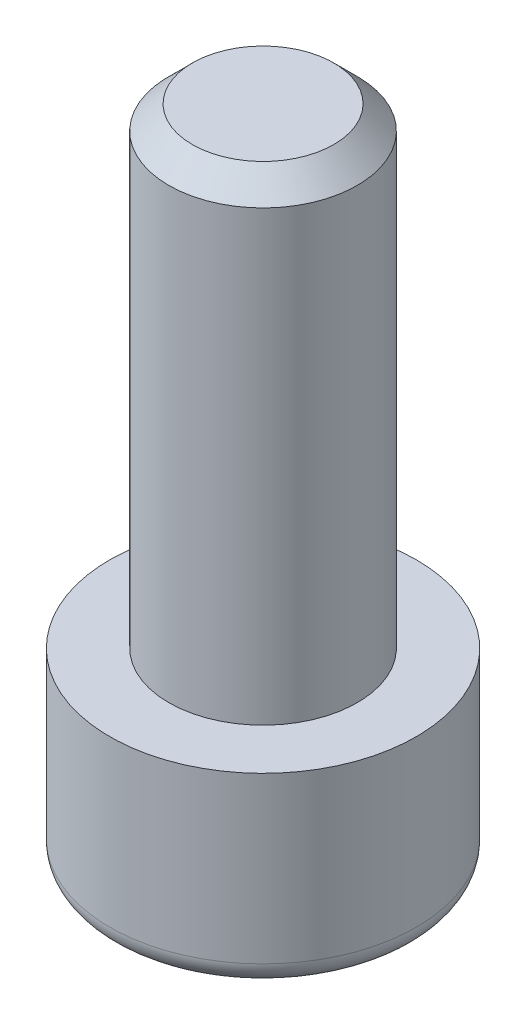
ISO-10303-21;
HEADER;
FILE_DESCRIPTION(('STEP AP214'),'2;1');
FILE_NAME('part.step','',(''),(''),'','','');
FILE_SCHEMA(('AUTOMOTIVE_DESIGN { 1 0 10303 214 1 1 1 1 }'));
ENDSEC;
DATA;
#1=APPLICATION_CONTEXT('core data for automotive mechanical design processes');
#2=APPLICATION_PROTOCOL_DEFINITION('international standard','automotive_design',2000,#1);
#3=PRODUCT_CONTEXT('',#1,'mechanical');
#4=PRODUCT('Part','Part','',(#3));
#5=PRODUCT_RELATED_PRODUCT_CATEGORY('part','',(#4));
#6=PRODUCT_DEFINITION_FORMATION('','',#4);
#7=PRODUCT_DEFINITION_CONTEXT('part definition',#1,'design');
#8=PRODUCT_DEFINITION('design','',#6,#7);
#9=PRODUCT_DEFINITION_SHAPE('','',#8);
#10=(LENGTH_UNIT() NAMED_UNIT(*) SI_UNIT(.MILLI.,.METRE.));
#11=(NAMED_UNIT(*) PLANE_ANGLE_UNIT() SI_UNIT($,.RADIAN.));
#12=(NAMED_UNIT(*) SI_UNIT($,.STERADIAN.) SOLID_ANGLE_UNIT());
#13=UNCERTAINTY_MEASURE_WITH_UNIT(LENGTH_MEASURE(1.E-05),#10,'distance_accuracy_value','');
#14=(GEOMETRIC_REPRESENTATION_CONTEXT(3) GLOBAL_UNCERTAINTY_ASSIGNED_CONTEXT((#13)) GLOBAL_UNIT_ASSIGNED_CONTEXT((#10,
#11,#12)) REPRESENTATION_CONTEXT('',''));
#15=CARTESIAN_POINT('',(0.,0.,0.));
#16=DIRECTION('',(0.,0.,1.));
#17=DIRECTION('',(1.,0.,0.));
#18=AXIS2_PLACEMENT_3D('',#15,#16,#17);
#19=CARTESIAN_POINT('',(0.,20.,0.));
#20=DIRECTION('',(0.,-1.,0.));
#21=DIRECTION('',(0.,0.,-1.));
#22=AXIS2_PLACEMENT_3D('',#19,#20,#21);
#23=CYLINDRICAL_SURFACE('',#22,4.);
#24=CARTESIAN_POINT('',(0.,19.,0.));
#25=DIRECTION('',(0.,1.,0.));
#26=DIRECTION('',(0.,0.,1.));
#27=AXIS2_PLACEMENT_3D('',#24,#25,#26);
#28=CIRCLE('',#27,4.);
#29=CARTESIAN_POINT('',(0.,19.,4.));
#30=VERTEX_POINT('',#29);
#31=EDGE_CURVE('E147',#30,#30,#28,.F.);
#32=ORIENTED_EDGE('',*,*,#31,.T.);
#33=EDGE_LOOP('',(#32));
#34=FACE_BOUND('',#33,.T.);
#35=CARTESIAN_POINT('',(0.,0.,0.));
#36=DIRECTION('',(0.,-1.,0.));
#37=DIRECTION('',(0.,0.,-1.));
#38=AXIS2_PLACEMENT_3D('',#35,#36,#37);
#39=CIRCLE('',#38,4.);
#40=CARTESIAN_POINT('',(0.,0.,-4.));
#41=VERTEX_POINT('',#40);
#42=EDGE_CURVE('E141',#41,#41,#39,.T.);
#43=ORIENTED_EDGE('',*,*,#42,.F.);
#44=EDGE_LOOP('',(#43));
#45=FACE_BOUND('',#44,.T.);
#46=ADVANCED_FACE('F30',(#34,#45),#23,.T.);
#47=CARTESIAN_POINT('',(0.,20.,0.));
#48=DIRECTION('',(0.,1.,0.));
#49=DIRECTION('',(0.,0.,1.));
#50=AXIS2_PLACEMENT_3D('',#47,#48,#49);
#51=PLANE('',#50);
#52=CARTESIAN_POINT('',(0.,20.,0.));
#53=DIRECTION('',(0.,1.,0.));
#54=DIRECTION('',(0.,0.,1.));
#55=AXIS2_PLACEMENT_3D('',#52,#53,#54);
#56=CIRCLE('',#55,3.);
#57=CARTESIAN_POINT('',(0.,20.,3.));
#58=VERTEX_POINT('',#57);
#59=EDGE_CURVE('E144',#58,#58,#56,.T.);
#60=ORIENTED_EDGE('',*,*,#59,.T.);
#61=EDGE_LOOP('',(#60));
#62=FACE_BOUND('',#61,.T.);
#63=ADVANCED_FACE('F168',(#62),#51,.T.);
#64=CARTESIAN_POINT('',(0.,20.,0.));
#65=DIRECTION('',(0.,-1.,0.));
#66=DIRECTION('',(0.,0.,-1.));
#67=AXIS2_PLACEMENT_3D('',#64,#65,#66);
#68=CONICAL_SURFACE('',#67,3.,0.785398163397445);
#69=ORIENTED_EDGE('',*,*,#31,.F.);
#70=EDGE_LOOP('',(#69));
#71=FACE_BOUND('',#70,.T.);
#72=ORIENTED_EDGE('',*,*,#59,.F.);
#73=EDGE_LOOP('',(#72));
#74=FACE_BOUND('',#73,.T.);
#75=ADVANCED_FACE('F173',(#71,#74),#68,.T.);
#76=CARTESIAN_POINT('',(0.,0.,0.));
#77=DIRECTION('',(0.,-1.,0.));
#78=DIRECTION('',(0.,0.,-1.));
#79=AXIS2_PLACEMENT_3D('',#76,#77,#78);
#80=PLANE('',#79);
#81=CARTESIAN_POINT('',(0.,0.,0.));
#82=DIRECTION('',(0.,-1.,0.));
#83=DIRECTION('',(0.,0.,-1.));
#84=AXIS2_PLACEMENT_3D('',#81,#82,#83);
#85=CIRCLE('',#84,6.5);
#86=CARTESIAN_POINT('',(0.,0.,-6.5));
#87=VERTEX_POINT('',#86);
#88=EDGE_CURVE('E132',#87,#87,#85,.T.);
#89=ORIENTED_EDGE('',*,*,#88,.F.);
#90=EDGE_LOOP('',(#89));
#91=FACE_BOUND('',#90,.T.);
#92=ORIENTED_EDGE('',*,*,#42,.T.);
#93=EDGE_LOOP('',(#92));
#94=FACE_BOUND('',#93,.T.);
#95=ADVANCED_FACE('F179',(#91,#94),#80,.F.);
#96=CARTESIAN_POINT('',(0.,-8.,0.));
#97=DIRECTION('',(0.,1.,0.));
#98=DIRECTION('',(0.,0.,1.));
#99=AXIS2_PLACEMENT_3D('',#96,#97,#98);
#100=CYLINDRICAL_SURFACE('',#99,6.5);
#101=CARTESIAN_POINT('',(0.,-7.,0.));
#102=DIRECTION('',(0.,-1.,0.));
#103=DIRECTION('',(0.,0.,-1.));
#104=AXIS2_PLACEMENT_3D('',#101,#102,#103);
#105=CIRCLE('',#104,6.5);
#106=CARTESIAN_POINT('',(0.,-7.,-6.5));
#107=VERTEX_POINT('',#106);
#108=EDGE_CURVE('E11',#107,#107,#105,.F.);
#109=ORIENTED_EDGE('',*,*,#108,.T.);
#110=EDGE_LOOP('',(#109));
#111=FACE_BOUND('',#110,.T.);
#112=ORIENTED_EDGE('',*,*,#88,.T.);
#113=EDGE_LOOP('',(#112));
#114=FACE_BOUND('',#113,.T.);
#115=ADVANCED_FACE('F163',(#111,#114),#100,.T.);
#116=CARTESIAN_POINT('',(0.,-8.,0.));
#117=DIRECTION('',(0.,-1.,0.));
#118=DIRECTION('',(0.,0.,-1.));
#119=AXIS2_PLACEMENT_3D('',#116,#117,#118);
#120=PLANE('',#119);
#121=DIRECTION('',(-0.867435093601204,0.,0.497550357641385));
#122=VECTOR('',#121,1.);
#123=CARTESIAN_POINT('',(0.,-8.,3.45));
#124=LINE('',#123,#122);
#125=CARTESIAN_POINT('',(3.,-8.,1.72923600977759));
#126=VERTEX_POINT('',#125);
#127=CARTESIAN_POINT('',(0.,-8.,3.45));
#128=VERTEX_POINT('',#127);
#129=EDGE_CURVE('E44',#126,#128,#124,.T.);
#130=ORIENTED_EDGE('',*,*,#129,.F.);
#131=DIRECTION('',(0.,0.,1.));
#132=VECTOR('',#131,1.);
#133=CARTESIAN_POINT('',(3.,-8.,1.72923600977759));
#134=LINE('',#133,#132);
#135=CARTESIAN_POINT('',(3.,-8.,-1.72923600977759));
#136=VERTEX_POINT('',#135);
#137=EDGE_CURVE('E114',#136,#126,#134,.T.);
#138=ORIENTED_EDGE('',*,*,#137,.F.);
#139=DIRECTION('',(0.867435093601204,0.,0.497550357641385));
#140=VECTOR('',#139,1.);
#141=CARTESIAN_POINT('',(3.,-8.,-1.72923600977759));
#142=LINE('',#141,#140);
#143=CARTESIAN_POINT('',(0.,-8.,-3.45));
#144=VERTEX_POINT('',#143);
#145=EDGE_CURVE('E108',#144,#136,#142,.T.);
#146=ORIENTED_EDGE('',*,*,#145,.F.);
#147=DIRECTION('',(0.867435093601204,0.,-0.497550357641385));
#148=VECTOR('',#147,1.);
#149=CARTESIAN_POINT('',(0.,-8.,-3.45));
#150=LINE('',#149,#148);
#151=CARTESIAN_POINT('',(-3.,-8.,-1.72923600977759));
#152=VERTEX_POINT('',#151);
#153=EDGE_CURVE('E106',#152,#144,#150,.T.);
#154=ORIENTED_EDGE('',*,*,#153,.F.);
#155=DIRECTION('',(0.,0.,-1.));
#156=VECTOR('',#155,1.);
#157=CARTESIAN_POINT('',(-3.,-8.,-1.72923600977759));
#158=LINE('',#157,#156);
#159=CARTESIAN_POINT('',(-3.,-8.,1.72923600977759));
#160=VERTEX_POINT('',#159);
#161=EDGE_CURVE('E87',#160,#152,#158,.T.);
#162=ORIENTED_EDGE('',*,*,#161,.F.);
#163=DIRECTION('',(-0.867435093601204,0.,-0.497550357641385));
#164=VECTOR('',#163,1.);
#165=CARTESIAN_POINT('',(-3.,-8.,1.72923600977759));
#166=LINE('',#165,#164);
#167=EDGE_CURVE('E98',#128,#160,#166,.T.);
#168=ORIENTED_EDGE('',*,*,#167,.F.);
#169=EDGE_LOOP('',(#130,#138,#146,#154,#162,#168));
#170=FACE_BOUND('',#169,.T.);
#171=CARTESIAN_POINT('',(0.,-8.,0.));
#172=DIRECTION('',(0.,-1.,0.));
#173=DIRECTION('',(0.,0.,-1.));
#174=AXIS2_PLACEMENT_3D('',#171,#172,#173);
#175=CIRCLE('',#174,5.5);
#176=CARTESIAN_POINT('',(0.,-8.,-5.5));
#177=VERTEX_POINT('',#176);
#178=EDGE_CURVE('E37',#177,#177,#175,.T.);
#179=ORIENTED_EDGE('',*,*,#178,.T.);
#180=EDGE_LOOP('',(#179));
#181=FACE_BOUND('',#180,.T.);
#182=ADVANCED_FACE('F102',(#170,#181),#120,.T.);
#183=CARTESIAN_POINT('',(0.,-7.,0.));
#184=DIRECTION('',(0.,-1.,0.));
#185=DIRECTION('',(0.,0.,-1.));
#186=AXIS2_PLACEMENT_3D('',#183,#184,#185);
#187=TOROIDAL_SURFACE('',#186,5.5,1.);
#188=ORIENTED_EDGE('',*,*,#108,.F.);
#189=EDGE_LOOP('',(#188));
#190=FACE_BOUND('',#189,.T.);
#191=ORIENTED_EDGE('',*,*,#178,.F.);
#192=EDGE_LOOP('',(#191));
#193=FACE_BOUND('',#192,.T.);
#194=ADVANCED_FACE('F152',(#190,#193),#187,.T.);
#195=CARTESIAN_POINT('',(0.,-2.,3.45));
#196=DIRECTION('',(0.497550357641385,0.,0.867435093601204));
#197=DIRECTION('',(0.867435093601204,0.,-0.497550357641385));
#198=AXIS2_PLACEMENT_3D('',#195,#196,#197);
#199=PLANE('',#198);
#200=ORIENTED_EDGE('',*,*,#129,.T.);
#201=DIRECTION('',(0.,-1.,0.));
#202=VECTOR('',#201,1.);
#203=CARTESIAN_POINT('',(0.,-2.,3.45));
#204=LINE('',#203,#202);
#205=CARTESIAN_POINT('',(0.,-2.,3.45));
#206=VERTEX_POINT('',#205);
#207=EDGE_CURVE('E95',#206,#128,#204,.T.);
#208=ORIENTED_EDGE('',*,*,#207,.F.);
#209=DIRECTION('',(-0.867435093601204,0.,0.497550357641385));
#210=VECTOR('',#209,1.);
#211=CARTESIAN_POINT('',(0.,-2.,3.45));
#212=LINE('',#211,#210);
#213=CARTESIAN_POINT('',(3.,-2.,1.72923600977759));
#214=VERTEX_POINT('',#213);
#215=EDGE_CURVE('E116',#214,#206,#212,.T.);
#216=ORIENTED_EDGE('',*,*,#215,.F.);
#217=DIRECTION('',(0.,-1.,0.));
#218=VECTOR('',#217,1.);
#219=CARTESIAN_POINT('',(3.,-2.,1.72923600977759));
#220=LINE('',#219,#218);
#221=EDGE_CURVE('E51',#214,#126,#220,.T.);
#222=ORIENTED_EDGE('',*,*,#221,.T.);
#223=EDGE_LOOP('',(#200,#208,#216,#222));
#224=FACE_BOUND('',#223,.T.);
#225=ADVANCED_FACE('F154',(#224),#199,.F.);
#226=CARTESIAN_POINT('',(3.,-2.,1.72923600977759));
#227=DIRECTION('',(1.,0.,0.));
#228=DIRECTION('',(0.,0.,-1.));
#229=AXIS2_PLACEMENT_3D('',#226,#227,#228);
#230=PLANE('',#229);
#231=ORIENTED_EDGE('',*,*,#137,.T.);
#232=ORIENTED_EDGE('',*,*,#221,.F.);
#233=DIRECTION('',(0.,0.,1.));
#234=VECTOR('',#233,1.);
#235=CARTESIAN_POINT('',(3.,-2.,1.72923600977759));
#236=LINE('',#235,#234);
#237=CARTESIAN_POINT('',(3.,-2.,-1.72923600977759));
#238=VERTEX_POINT('',#237);
#239=EDGE_CURVE('E128',#238,#214,#236,.T.);
#240=ORIENTED_EDGE('',*,*,#239,.F.);
#241=DIRECTION('',(0.,-1.,0.));
#242=VECTOR('',#241,1.);
#243=CARTESIAN_POINT('',(3.,-2.,-1.72923600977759));
#244=LINE('',#243,#242);
#245=EDGE_CURVE('E133',#238,#136,#244,.T.);
#246=ORIENTED_EDGE('',*,*,#245,.T.);
#247=EDGE_LOOP('',(#231,#232,#240,#246));
#248=FACE_BOUND('',#247,.T.);
#249=ADVANCED_FACE('F161',(#248),#230,.F.);
#250=CARTESIAN_POINT('',(3.,-2.,-1.72923600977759));
#251=DIRECTION('',(0.497550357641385,0.,-0.867435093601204));
#252=DIRECTION('',(-0.867435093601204,0.,-0.497550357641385));
#253=AXIS2_PLACEMENT_3D('',#250,#251,#252);
#254=PLANE('',#253);
#255=ORIENTED_EDGE('',*,*,#145,.T.);
#256=ORIENTED_EDGE('',*,*,#245,.F.);
#257=DIRECTION('',(0.867435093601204,0.,0.497550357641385));
#258=VECTOR('',#257,1.);
#259=CARTESIAN_POINT('',(3.,-2.,-1.72923600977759));
#260=LINE('',#259,#258);
#261=CARTESIAN_POINT('',(0.,-2.,-3.45));
#262=VERTEX_POINT('',#261);
#263=EDGE_CURVE('E125',#262,#238,#260,.T.);
#264=ORIENTED_EDGE('',*,*,#263,.F.);
#265=DIRECTION('',(0.,-1.,0.));
#266=VECTOR('',#265,1.);
#267=CARTESIAN_POINT('',(0.,-2.,-3.45));
#268=LINE('',#267,#266);
#269=EDGE_CURVE('E135',#262,#144,#268,.T.);
#270=ORIENTED_EDGE('',*,*,#269,.T.);
#271=EDGE_LOOP('',(#255,#256,#264,#270));
#272=FACE_BOUND('',#271,.T.);
#273=ADVANCED_FACE('F239',(#272),#254,.F.);
#274=CARTESIAN_POINT('',(0.,-2.,-3.45));
#275=DIRECTION('',(-0.497550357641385,0.,-0.867435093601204));
#276=DIRECTION('',(-0.867435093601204,0.,0.497550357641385));
#277=AXIS2_PLACEMENT_3D('',#274,#275,#276);
#278=PLANE('',#277);
#279=ORIENTED_EDGE('',*,*,#153,.T.);
#280=ORIENTED_EDGE('',*,*,#269,.F.);
#281=DIRECTION('',(0.867435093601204,0.,-0.497550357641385));
#282=VECTOR('',#281,1.);
#283=CARTESIAN_POINT('',(0.,-2.,-3.45));
#284=LINE('',#283,#282);
#285=CARTESIAN_POINT('',(-3.,-2.,-1.72923600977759));
#286=VERTEX_POINT('',#285);
#287=EDGE_CURVE('E122',#286,#262,#284,.T.);
#288=ORIENTED_EDGE('',*,*,#287,.F.);
#289=DIRECTION('',(0.,-1.,0.));
#290=VECTOR('',#289,1.);
#291=CARTESIAN_POINT('',(-3.,-2.,-1.72923600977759));
#292=LINE('',#291,#290);
#293=EDGE_CURVE('E94',#286,#152,#292,.T.);
#294=ORIENTED_EDGE('',*,*,#293,.T.);
#295=EDGE_LOOP('',(#279,#280,#288,#294));
#296=FACE_BOUND('',#295,.T.);
#297=ADVANCED_FACE('F247',(#296),#278,.F.);
#298=CARTESIAN_POINT('',(-3.,-2.,-1.72923600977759));
#299=DIRECTION('',(-1.,0.,0.));
#300=DIRECTION('',(0.,0.,1.));
#301=AXIS2_PLACEMENT_3D('',#298,#299,#300);
#302=PLANE('',#301);
#303=ORIENTED_EDGE('',*,*,#161,.T.);
#304=ORIENTED_EDGE('',*,*,#293,.F.);
#305=DIRECTION('',(0.,0.,-1.));
#306=VECTOR('',#305,1.);
#307=CARTESIAN_POINT('',(-3.,-2.,-1.72923600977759));
#308=LINE('',#307,#306);
#309=CARTESIAN_POINT('',(-3.,-2.,1.72923600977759));
#310=VERTEX_POINT('',#309);
#311=EDGE_CURVE('E90',#310,#286,#308,.T.);
#312=ORIENTED_EDGE('',*,*,#311,.F.);
#313=DIRECTION('',(0.,-1.,0.));
#314=VECTOR('',#313,1.);
#315=CARTESIAN_POINT('',(-3.,-2.,1.72923600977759));
#316=LINE('',#315,#314);
#317=EDGE_CURVE('E83',#310,#160,#316,.T.);
#318=ORIENTED_EDGE('',*,*,#317,.T.);
#319=EDGE_LOOP('',(#303,#304,#312,#318));
#320=FACE_BOUND('',#319,.T.);
#321=ADVANCED_FACE('F85',(#320),#302,.F.);
#322=CARTESIAN_POINT('',(-3.,-2.,1.72923600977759));
#323=DIRECTION('',(-0.497550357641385,0.,0.867435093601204));
#324=DIRECTION('',(0.867435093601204,0.,0.497550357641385));
#325=AXIS2_PLACEMENT_3D('',#322,#323,#324);
#326=PLANE('',#325);
#327=ORIENTED_EDGE('',*,*,#167,.T.);
#328=ORIENTED_EDGE('',*,*,#317,.F.);
#329=DIRECTION('',(-0.867435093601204,0.,-0.497550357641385));
#330=VECTOR('',#329,1.);
#331=CARTESIAN_POINT('',(-3.,-2.,1.72923600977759));
#332=LINE('',#331,#330);
#333=EDGE_CURVE('E119',#206,#310,#332,.T.);
#334=ORIENTED_EDGE('',*,*,#333,.F.);
#335=ORIENTED_EDGE('',*,*,#207,.T.);
#336=EDGE_LOOP('',(#327,#328,#334,#335));
#337=FACE_BOUND('',#336,.T.);
#338=ADVANCED_FACE('F99',(#337),#326,.F.);
#339=CARTESIAN_POINT('',(3.,-2.,1.72923600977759));
#340=DIRECTION('',(0.,1.,0.));
#341=DIRECTION('',(0.,0.,1.));
#342=AXIS2_PLACEMENT_3D('',#339,#340,#341);
#343=PLANE('',#342);
#344=ORIENTED_EDGE('',*,*,#215,.T.);
#345=ORIENTED_EDGE('',*,*,#333,.T.);
#346=ORIENTED_EDGE('',*,*,#311,.T.);
#347=ORIENTED_EDGE('',*,*,#287,.T.);
#348=ORIENTED_EDGE('',*,*,#263,.T.);
#349=ORIENTED_EDGE('',*,*,#239,.T.);
#350=EDGE_LOOP('',(#344,#345,#346,#347,#348,#349));
#351=FACE_BOUND('',#350,.T.);
#352=ADVANCED_FACE('F271',(#351),#343,.F.);
#353=CLOSED_SHELL('',(#46,#63,#75,#95,#115,#182,#194,#225,#249,#273,#297,#321,#338,#352));
#354=MANIFOLD_SOLID_BREP('B2',#353);
#355=ADVANCED_BREP_SHAPE_REPRESENTATION('',(#18,#354),#14);
#356=SHAPE_DEFINITION_REPRESENTATION(#9,#355);
ENDSEC;
END-ISO-10303-21;
